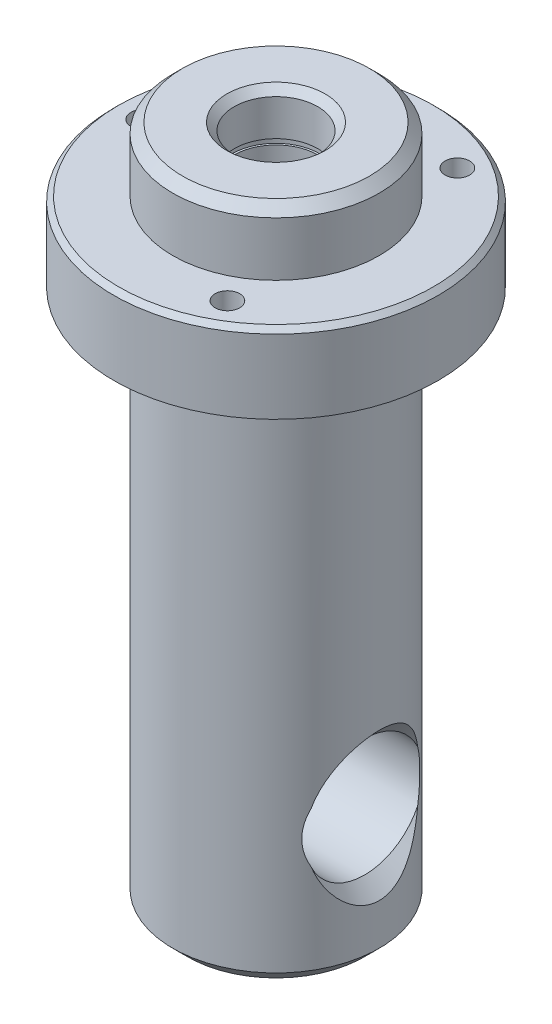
from build123d import *

# Parameters (mm, degrees)
CHANFREIN1_SIZE                      = 2
CHANFREIN2_SIZE                      = 1
CHANFREIN3_SIZE                      = 3
ENL_V_MAT_EXTRU_1_DEPTH              = 146.677726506
ENL_V_MAT_EXTRU_1_DEPTH_BACK         = 146.677726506
ESQUISSE2_W                          = 37.819989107
ESQUISSE2_H                          = 85.001361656
ESQUISSE3_R                          = 4.5
ENL_V_MAT_EXTRU_2_DEPTH              = 4
ENL_V_MAT_EXTRU_2_DRAFT              = -30
R_P_TITION_LIN_AIRE1_COPY_1_SKETCH_R = 4.5
R_P_TITION_LIN_AIRE1_COPY_1_DEPTH    = 4
R_P_TITION_LIN_AIRE1_COPY_1_DRAFT    = -30
R_P_TITION_LIN_AIRE1_COPY_2_SKETCH_R = 4.5
R_P_TITION_LIN_AIRE1_COPY_2_DEPTH    = 4
R_P_TITION_LIN_AIRE1_COPY_2_DRAFT    = -30
ESQUISSE4_R                          = 12
ENL_V_MAT_EXTRU_3_DEPTH              = 30
ESQUISSE6_R                          = 8.5
ENL_V_MAT_EXTRU_4_DEPTH              = 16
ESQUISSE7_W                          = 8.9
ESQUISSE7_H                          = 1.1
CHANFREIN4_SIZE                      = 1.5
R_P_TITION_CIRCULAIRE1_COUNT         = 3


with BuildPart() as part:
    # Esquisse1 → R_volution1 (revolve)
    with BuildSketch(Plane.XY):
        Polygon((0, 0), (-21, 0), (-21, -13), (-33, -13), (-33, -29), (-26, -29), (-21, -34), (-21, -138), (0, -138), align=None)
    revolve(axis=Axis((0, -138, 0), (0, -1, 0)))

    # Chanfrein1
    chanfrein1_edges = [part.edges().sort_by_distance(p)[0] for p in [
        (21, 0, 0),
    ]]
    chamfer(chanfrein1_edges, length=CHANFREIN1_SIZE)

    # Chanfrein2
    chanfrein2_edges = [part.edges().sort_by_distance(p)[0] for p in [
        (33, -13, 0),
    ]]
    chamfer(chanfrein2_edges, length=CHANFREIN2_SIZE)

    # Chanfrein3
    chanfrein3_edges = [part.edges().sort_by_distance(p)[0] for p in [
        (21, -138, 0),
    ]]
    chamfer(chanfrein3_edges, length=CHANFREIN3_SIZE)

    # Esquisse2 → Enl_v. mat.-Extru.1 (cut, two sides: drawn at the far end of the back side and taken through both)
    with BuildSketch(Plane.XY.offset(-ENL_V_MAT_EXTRU_1_DEPTH_BACK)):
        with Locations((-35.909994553, -117.000680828)):
            Rectangle(ESQUISSE2_W, ESQUISSE2_H)
    extrude(amount=ENL_V_MAT_EXTRU_1_DEPTH + ENL_V_MAT_EXTRU_1_DEPTH_BACK, mode=Mode.SUBTRACT)


with BuildPart() as enl_v_mat_extru_2_tool:
    # Esquisse3 → Enl_v. mat.-Extru.2 (with draft: the straight prism first)
    with BuildSketch(Plane.ZY.offset(17)):
        with Locations((0, -82.5)):
            Circle(ESQUISSE3_R)
    extrude(amount=-ENL_V_MAT_EXTRU_2_DEPTH)
    # Enl_v. mat.-Extru.2: the draft: its side faces are tilted about the plane it starts from
    enl_v_mat_extru_2_sides = [enl_v_mat_extru_2_tool.faces().sort_by_distance(p)[0] for p in [
        (-15, -82.5, -4.5),
    ]]
    draft(enl_v_mat_extru_2_sides, Plane.ZY.offset(17), ENL_V_MAT_EXTRU_2_DRAFT)


with BuildPart() as part_1:
    add(part.part)

    # Enl_v. mat.-Extru.2: cut by enl_v_mat_extru_2_tool
    add(enl_v_mat_extru_2_tool.part, mode=Mode.SUBTRACT)


with BuildPart() as r_p_tition_lin_aire1_copy_1_tool:
    # R_p_tition lin_aire1 copy 1 sketch → R_p_tition lin_aire1 copy 1 (with draft: the straight prism first)
    with BuildSketch(Plane(origin=(-17, -17, 0), x_dir=(0, 0, 1), z_dir=(-1, 0, 0))):
        with Locations((0, -82.5)):
            Circle(R_P_TITION_LIN_AIRE1_COPY_1_SKETCH_R)
    extrude(amount=-R_P_TITION_LIN_AIRE1_COPY_1_DEPTH)
    # R_p_tition lin_aire1 copy 1: the draft: its side faces are tilted about the plane it starts from
    r_p_tition_lin_aire1_copy_1_sides = [r_p_tition_lin_aire1_copy_1_tool.faces().sort_by_distance(p)[0] for p in [
        (-15, -99.5, -4.5),
    ]]
    draft(r_p_tition_lin_aire1_copy_1_sides, Plane(origin=(-17, -17, 0), x_dir=(0, 0, 1), z_dir=(-1, 0, 0)), R_P_TITION_LIN_AIRE1_COPY_1_DRAFT)


with BuildPart() as part_2:
    add(part_1.part)

    # R_p_tition lin_aire1 copy 1: cut by r_p_tition_lin_aire1_copy_1_tool
    add(r_p_tition_lin_aire1_copy_1_tool.part, mode=Mode.SUBTRACT)


with BuildPart() as r_p_tition_lin_aire1_copy_2_tool:
    # R_p_tition lin_aire1 copy 2 sketch → R_p_tition lin_aire1 copy 2 (with draft: the straight prism first)
    with BuildSketch(Plane(origin=(-17, -34, 0), x_dir=(0, 0, 1), z_dir=(-1, 0, 0))):
        with Locations((0, -82.5)):
            Circle(R_P_TITION_LIN_AIRE1_COPY_2_SKETCH_R)
    extrude(amount=-R_P_TITION_LIN_AIRE1_COPY_2_DEPTH)
    # R_p_tition lin_aire1 copy 2: the draft: its side faces are tilted about the plane it starts from
    r_p_tition_lin_aire1_copy_2_sides = [r_p_tition_lin_aire1_copy_2_tool.faces().sort_by_distance(p)[0] for p in [
        (-15, -116.5, -4.5),
    ]]
    draft(r_p_tition_lin_aire1_copy_2_sides, Plane(origin=(-17, -34, 0), x_dir=(0, 0, 1), z_dir=(-1, 0, 0)), R_P_TITION_LIN_AIRE1_COPY_2_DRAFT)


with BuildPart() as part_3:
    add(part_2.part)

    # R_p_tition lin_aire1 copy 2: cut by r_p_tition_lin_aire1_copy_2_tool
    add(r_p_tition_lin_aire1_copy_2_tool.part, mode=Mode.SUBTRACT)

    # Esquisse4 → Enl_v. mat.-Extru.3 (cut)
    with BuildSketch(Plane(origin=(21, -84.5, 0), x_dir=(0, 0, -1), z_dir=(1, 0, 0))):
        with Locations(Location((0, -27.1, 0), (0, 0, 90))):
            Circle(ESQUISSE4_R)
    extrude(amount=-ENL_V_MAT_EXTRU_3_DEPTH, mode=Mode.SUBTRACT)

    # Esquisse6 → Enl_v. mat.-Extru.4 (cut)
    with BuildSketch(Plane(origin=(0, 0, 0), x_dir=(-1, 0, 0), z_dir=(0, 1, 0))):
        Circle(ESQUISSE6_R)
    extrude(amount=-ENL_V_MAT_EXTRU_4_DEPTH, mode=Mode.SUBTRACT)

    # Esquisse7 → Enl_vement de mati_re-R_volution1 (revolve, cut)
    with BuildSketch(Plane.XY):
        with Locations((-4.45, -9.45)):
            Rectangle(ESQUISSE7_W, ESQUISSE7_H)
    revolve(axis=Axis((0, 0, 0), (0, -1, 0)), mode=Mode.SUBTRACT)

    # Chanfrein4
    chanfrein4_edges = [part_3.edges().sort_by_distance(p)[0] for p in [
        (8.5, 0, 0),
    ]]
    chamfer(chanfrein4_edges, length=CHANFREIN4_SIZE)

    # Esquisse9 → Trou taraud_ M6x1.01 (revolve, cut)
    with BuildSketch(Plane(origin=(-27, -13, 0), x_dir=(0, 0, 1), z_dir=(1, 0, 0))):
        Polygon((0, 0), (0, 14.443375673), (2.5, 13), (2.5, 0), align=None)
    trou_taraud_m6x1_01 = revolve(axis=Axis((-27, -6.65, 0), (0, -1, 0)), mode=Mode.SUBTRACT)

    # R_p_tition circulaire1: Trou taraud_ M6x1.01 ×3 about axis
    r_p_tition_circulaire1_axis = Axis((0, 0, 0), (0, 1, 0))
    for i in range(1, R_P_TITION_CIRCULAIRE1_COUNT):
        add(trou_taraud_m6x1_01.rotate(r_p_tition_circulaire1_axis, i * 360 / R_P_TITION_CIRCULAIRE1_COUNT), mode=Mode.SUBTRACT)

    # Esquisse13 → Enl_vement de mati_re-R_volution2 (revolve, cut)
    with BuildSketch(Plane.XY):
        Polygon((21, -96.6), (18, -99.6), (21, -99.6), align=None)
    revolve(axis=Axis((20.999958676, -111.6, 0), (-1, 0, 0)), mode=Mode.SUBTRACT)


solid = part_3.part
